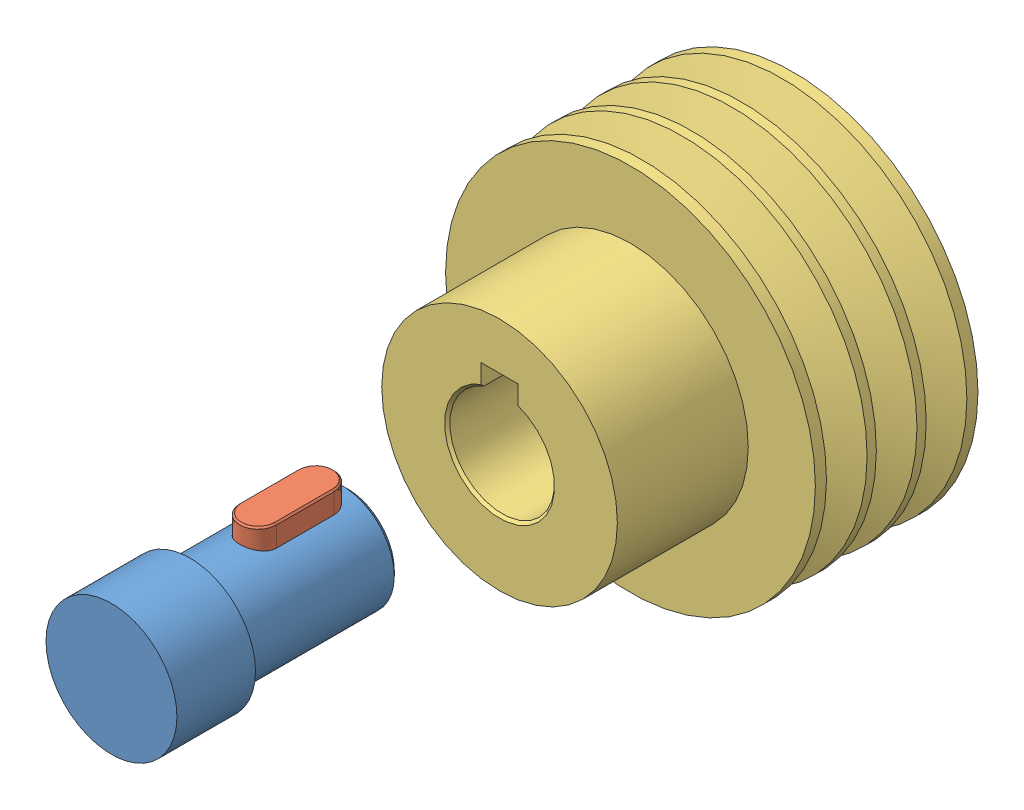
SolidWorks assembly 装配体.SLDASM, configuration 默认 (file format 3400). Lengths in mm.
Overall size (141.22 141.22 260.3).
3 component instances, 3 part files, 4 mates.
Components (placement in the parent):
- 轴-1: 轴.SLDPRT [默认] at (-8.9055 -3.5068 -45) size (50 50 90)
- 键-1: 键.SLDPRT [GB_CONNECTING_PIECE_KEYS_CSK 14X36] at (-8.9055 18.9932 -33) x (0 0 -1) z (0 -1 0) size (36 14 9)
- v带轮-1: v带轮.SLDPRT [默认] at (-8.9055 -3.5068 -203.2997) size (141.22 141.22 112.1)
Mates (geometry in assembly coordinates):
- 重合3: coincident anti-aligned: plane of 轴-1 through (-8.9055 14.4932 -11) normal (0 1 0)
- 同心3: concentric aligned: cylinder of 轴-1
- 同心4: concentric aligned: circle of 轴-1; circle of v带轮-1
- 平行3: parallel: line of v带轮-1
